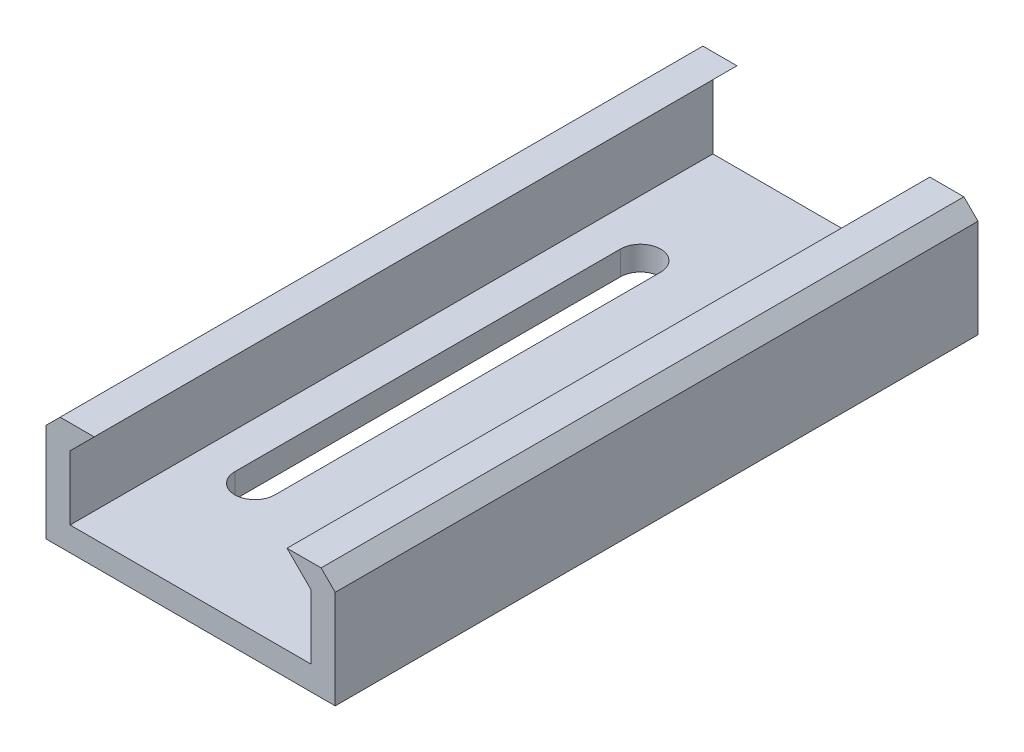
ISO-10303-21;
HEADER;
FILE_DESCRIPTION(('STEP AP214'),'2;1');
FILE_NAME('part.step','',(''),(''),'','','');
FILE_SCHEMA(('AUTOMOTIVE_DESIGN { 1 0 10303 214 1 1 1 1 }'));
ENDSEC;
DATA;
#1=APPLICATION_CONTEXT('core data for automotive mechanical design processes');
#2=APPLICATION_PROTOCOL_DEFINITION('international standard','automotive_design',2000,#1);
#3=PRODUCT_CONTEXT('',#1,'mechanical');
#4=PRODUCT('Part','Part','',(#3));
#5=PRODUCT_RELATED_PRODUCT_CATEGORY('part','',(#4));
#6=PRODUCT_DEFINITION_FORMATION('','',#4);
#7=PRODUCT_DEFINITION_CONTEXT('part definition',#1,'design');
#8=PRODUCT_DEFINITION('design','',#6,#7);
#9=PRODUCT_DEFINITION_SHAPE('','',#8);
#10=(LENGTH_UNIT() NAMED_UNIT(*) SI_UNIT(.MILLI.,.METRE.));
#11=(NAMED_UNIT(*) PLANE_ANGLE_UNIT() SI_UNIT($,.RADIAN.));
#12=(NAMED_UNIT(*) SI_UNIT($,.STERADIAN.) SOLID_ANGLE_UNIT());
#13=UNCERTAINTY_MEASURE_WITH_UNIT(LENGTH_MEASURE(1.E-05),#10,'distance_accuracy_value','');
#14=(GEOMETRIC_REPRESENTATION_CONTEXT(3) GLOBAL_UNCERTAINTY_ASSIGNED_CONTEXT((#13)) GLOBAL_UNIT_ASSIGNED_CONTEXT((#10,
#11,#12)) REPRESENTATION_CONTEXT('',''));
#15=CARTESIAN_POINT('',(0.,0.,0.));
#16=DIRECTION('',(0.,0.,1.));
#17=DIRECTION('',(1.,0.,0.));
#18=AXIS2_PLACEMENT_3D('',#15,#16,#17);
#19=CARTESIAN_POINT('',(-47.625,0.,-254.));
#20=DIRECTION('',(1.,0.,0.));
#21=DIRECTION('',(0.,0.,-1.));
#22=AXIS2_PLACEMENT_3D('',#19,#20,#21);
#23=PLANE('',#22);
#24=DIRECTION('',(0.,1.,0.));
#25=VECTOR('',#24,1.);
#26=CARTESIAN_POINT('',(-47.625,0.,0.));
#27=LINE('',#26,#25);
#28=CARTESIAN_POINT('',(-47.625,0.,0.));
#29=VERTEX_POINT('',#28);
#30=CARTESIAN_POINT('',(-47.625,25.4,0.));
#31=VERTEX_POINT('',#30);
#32=EDGE_CURVE('E231',#29,#31,#27,.T.);
#33=ORIENTED_EDGE('',*,*,#32,.F.);
#34=DIRECTION('',(0.,0.,1.));
#35=VECTOR('',#34,1.);
#36=CARTESIAN_POINT('',(-47.625,0.,-254.));
#37=LINE('',#36,#35);
#38=CARTESIAN_POINT('',(-47.625,0.,-254.));
#39=VERTEX_POINT('',#38);
#40=EDGE_CURVE('E11',#39,#29,#37,.T.);
#41=ORIENTED_EDGE('',*,*,#40,.F.);
#42=DIRECTION('',(0.,1.,0.));
#43=VECTOR('',#42,1.);
#44=CARTESIAN_POINT('',(-47.625,0.,-254.));
#45=LINE('',#44,#43);
#46=CARTESIAN_POINT('',(-47.625,25.4,-254.));
#47=VERTEX_POINT('',#46);
#48=EDGE_CURVE('E267',#39,#47,#45,.T.);
#49=ORIENTED_EDGE('',*,*,#48,.T.);
#50=DIRECTION('',(0.,0.,1.));
#51=VECTOR('',#50,1.);
#52=CARTESIAN_POINT('',(-47.625,25.4,-254.));
#53=LINE('',#52,#51);
#54=EDGE_CURVE('E31',#47,#31,#53,.T.);
#55=ORIENTED_EDGE('',*,*,#54,.T.);
#56=EDGE_LOOP('',(#33,#41,#49,#55));
#57=FACE_BOUND('',#56,.T.);
#58=ADVANCED_FACE('F28',(#57),#23,.T.);
#59=CARTESIAN_POINT('',(-47.625,0.,-254.));
#60=DIRECTION('',(0.,1.,0.));
#61=DIRECTION('',(0.,0.,1.));
#62=AXIS2_PLACEMENT_3D('',#59,#60,#61);
#63=PLANE('',#62);
#64=CARTESIAN_POINT('',(-25.4,0.,-50.7999999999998));
#65=DIRECTION('',(0.,1.,0.));
#66=DIRECTION('',(0.,0.,1.));
#67=AXIS2_PLACEMENT_3D('',#64,#65,#66);
#68=CIRCLE('',#67,7.93750000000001);
#69=CARTESIAN_POINT('',(-33.3375,0.,-50.7999999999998));
#70=VERTEX_POINT('',#69);
#71=CARTESIAN_POINT('',(-17.4625,0.,-50.7999999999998));
#72=VERTEX_POINT('',#71);
#73=EDGE_CURVE('E198',#70,#72,#68,.T.);
#74=ORIENTED_EDGE('',*,*,#73,.F.);
#75=DIRECTION('',(0.,0.,1.));
#76=VECTOR('',#75,1.);
#77=CARTESIAN_POINT('',(-33.3375,0.,-254.));
#78=LINE('',#77,#76);
#79=CARTESIAN_POINT('',(-33.3375,0.,-203.2));
#80=VERTEX_POINT('',#79);
#81=EDGE_CURVE('E191',#80,#70,#78,.T.);
#82=ORIENTED_EDGE('',*,*,#81,.F.);
#83=CARTESIAN_POINT('',(-25.4,0.,-203.2));
#84=DIRECTION('',(0.,1.,0.));
#85=DIRECTION('',(0.,0.,1.));
#86=AXIS2_PLACEMENT_3D('',#83,#84,#85);
#87=CIRCLE('',#86,7.93750000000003);
#88=CARTESIAN_POINT('',(-17.4624999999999,0.,-203.2));
#89=VERTEX_POINT('',#88);
#90=EDGE_CURVE('E171',#80,#89,#87,.F.);
#91=ORIENTED_EDGE('',*,*,#90,.T.);
#92=DIRECTION('',(0.,0.,-1.));
#93=VECTOR('',#92,1.);
#94=CARTESIAN_POINT('',(-17.4624999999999,0.,-254.));
#95=LINE('',#94,#93);
#96=EDGE_CURVE('E196',#72,#89,#95,.T.);
#97=ORIENTED_EDGE('',*,*,#96,.F.);
#98=EDGE_LOOP('',(#74,#82,#91,#97));
#99=FACE_BOUND('',#98,.T.);
#100=CARTESIAN_POINT('',(25.4,0.,-203.2));
#101=DIRECTION('',(0.,1.,0.));
#102=DIRECTION('',(0.,0.,1.));
#103=AXIS2_PLACEMENT_3D('',#100,#101,#102);
#104=CIRCLE('',#103,7.93750000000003);
#105=CARTESIAN_POINT('',(33.3375000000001,0.,-203.2));
#106=VERTEX_POINT('',#105);
#107=CARTESIAN_POINT('',(17.4625,0.,-203.2));
#108=VERTEX_POINT('',#107);
#109=EDGE_CURVE('E229',#106,#108,#104,.T.);
#110=ORIENTED_EDGE('',*,*,#109,.F.);
#111=DIRECTION('',(0.,0.,1.));
#112=VECTOR('',#111,1.);
#113=CARTESIAN_POINT('',(33.3375000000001,0.,-254.));
#114=LINE('',#113,#112);
#115=CARTESIAN_POINT('',(33.3375,0.,-50.7999999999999));
#116=VERTEX_POINT('',#115);
#117=EDGE_CURVE('E214',#106,#116,#114,.T.);
#118=ORIENTED_EDGE('',*,*,#117,.T.);
#119=CARTESIAN_POINT('',(25.4,0.,-50.7999999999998));
#120=DIRECTION('',(0.,1.,0.));
#121=DIRECTION('',(0.,0.,1.));
#122=AXIS2_PLACEMENT_3D('',#119,#120,#121);
#123=CIRCLE('',#122,7.93749999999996);
#124=CARTESIAN_POINT('',(17.4625,0.,-50.7999999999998));
#125=VERTEX_POINT('',#124);
#126=EDGE_CURVE('E223',#116,#125,#123,.F.);
#127=ORIENTED_EDGE('',*,*,#126,.T.);
#128=DIRECTION('',(0.,0.,-1.));
#129=VECTOR('',#128,1.);
#130=CARTESIAN_POINT('',(17.4625,0.,-254.));
#131=LINE('',#130,#129);
#132=EDGE_CURVE('E226',#125,#108,#131,.T.);
#133=ORIENTED_EDGE('',*,*,#132,.T.);
#134=EDGE_LOOP('',(#110,#118,#127,#133));
#135=FACE_BOUND('',#134,.T.);
#136=DIRECTION('',(-1.,0.,0.));
#137=VECTOR('',#136,1.);
#138=CARTESIAN_POINT('',(-47.625,0.,0.));
#139=LINE('',#138,#137);
#140=CARTESIAN_POINT('',(47.625,0.,0.));
#141=VERTEX_POINT('',#140);
#142=EDGE_CURVE('E264',#141,#29,#139,.T.);
#143=ORIENTED_EDGE('',*,*,#142,.F.);
#144=DIRECTION('',(0.,0.,1.));
#145=VECTOR('',#144,1.);
#146=CARTESIAN_POINT('',(47.625,0.,-254.));
#147=LINE('',#146,#145);
#148=CARTESIAN_POINT('',(47.625,0.,-254.));
#149=VERTEX_POINT('',#148);
#150=EDGE_CURVE('E36',#149,#141,#147,.T.);
#151=ORIENTED_EDGE('',*,*,#150,.F.);
#152=DIRECTION('',(-1.,0.,0.));
#153=VECTOR('',#152,1.);
#154=CARTESIAN_POINT('',(-47.625,0.,-254.));
#155=LINE('',#154,#153);
#156=EDGE_CURVE('E300',#149,#39,#155,.T.);
#157=ORIENTED_EDGE('',*,*,#156,.T.);
#158=ORIENTED_EDGE('',*,*,#40,.T.);
#159=EDGE_LOOP('',(#143,#151,#157,#158));
#160=FACE_BOUND('',#159,.T.);
#161=ADVANCED_FACE('F333',(#99,#135,#160),#63,.T.);
#162=CARTESIAN_POINT('',(47.625,0.,-254.));
#163=DIRECTION('',(-1.,0.,0.));
#164=DIRECTION('',(0.,0.,1.));
#165=AXIS2_PLACEMENT_3D('',#162,#163,#164);
#166=PLANE('',#165);
#167=DIRECTION('',(0.,-1.,0.));
#168=VECTOR('',#167,1.);
#169=CARTESIAN_POINT('',(47.625,0.,0.));
#170=LINE('',#169,#168);
#171=CARTESIAN_POINT('',(47.625,25.4,0.));
#172=VERTEX_POINT('',#171);
#173=EDGE_CURVE('E261',#172,#141,#170,.T.);
#174=ORIENTED_EDGE('',*,*,#173,.F.);
#175=DIRECTION('',(0.,0.,1.));
#176=VECTOR('',#175,1.);
#177=CARTESIAN_POINT('',(47.625,25.4,-254.));
#178=LINE('',#177,#176);
#179=CARTESIAN_POINT('',(47.625,25.4,-254.));
#180=VERTEX_POINT('',#179);
#181=EDGE_CURVE('E304',#180,#172,#178,.T.);
#182=ORIENTED_EDGE('',*,*,#181,.F.);
#183=DIRECTION('',(0.,-1.,0.));
#184=VECTOR('',#183,1.);
#185=CARTESIAN_POINT('',(47.625,0.,-254.));
#186=LINE('',#185,#184);
#187=EDGE_CURVE('E297',#180,#149,#186,.T.);
#188=ORIENTED_EDGE('',*,*,#187,.T.);
#189=ORIENTED_EDGE('',*,*,#150,.T.);
#190=EDGE_LOOP('',(#174,#182,#188,#189));
#191=FACE_BOUND('',#190,.T.);
#192=ADVANCED_FACE('F369',(#191),#166,.T.);
#193=CARTESIAN_POINT('',(38.1,34.925,-254.));
#194=DIRECTION('',(-0.707106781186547,-0.707106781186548,0.));
#195=DIRECTION('',(0.707106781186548,-0.707106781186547,0.));
#196=AXIS2_PLACEMENT_3D('',#193,#194,#195);
#197=PLANE('',#196);
#198=DIRECTION('',(0.707106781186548,-0.707106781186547,0.));
#199=VECTOR('',#198,1.);
#200=CARTESIAN_POINT('',(38.1,34.925,0.));
#201=LINE('',#200,#199);
#202=CARTESIAN_POINT('',(38.1,34.925,0.));
#203=VERTEX_POINT('',#202);
#204=EDGE_CURVE('E258',#203,#172,#201,.T.);
#205=ORIENTED_EDGE('',*,*,#204,.F.);
#206=DIRECTION('',(0.,0.,1.));
#207=VECTOR('',#206,1.);
#208=CARTESIAN_POINT('',(38.1,34.925,-254.));
#209=LINE('',#208,#207);
#210=CARTESIAN_POINT('',(38.1,34.925,-254.));
#211=VERTEX_POINT('',#210);
#212=EDGE_CURVE('E306',#211,#203,#209,.T.);
#213=ORIENTED_EDGE('',*,*,#212,.F.);
#214=DIRECTION('',(0.707106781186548,-0.707106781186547,0.));
#215=VECTOR('',#214,1.);
#216=CARTESIAN_POINT('',(38.1,34.925,-254.));
#217=LINE('',#216,#215);
#218=EDGE_CURVE('E294',#211,#180,#217,.T.);
#219=ORIENTED_EDGE('',*,*,#218,.T.);
#220=ORIENTED_EDGE('',*,*,#181,.T.);
#221=EDGE_LOOP('',(#205,#213,#219,#220));
#222=FACE_BOUND('',#221,.T.);
#223=ADVANCED_FACE('F366',(#222),#197,.T.);
#224=CARTESIAN_POINT('',(38.1,34.925,-254.));
#225=DIRECTION('',(0.,1.,0.));
#226=DIRECTION('',(-1.,0.,0.));
#227=AXIS2_PLACEMENT_3D('',#224,#225,#226);
#228=PLANE('',#227);
#229=DIRECTION('',(-1.,0.,0.));
#230=VECTOR('',#229,1.);
#231=CARTESIAN_POINT('',(38.1,34.925,0.));
#232=LINE('',#231,#230);
#233=CARTESIAN_POINT('',(51.5703841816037,34.925,0.));
#234=VERTEX_POINT('',#233);
#235=EDGE_CURVE('E255',#234,#203,#232,.T.);
#236=ORIENTED_EDGE('',*,*,#235,.F.);
#237=DIRECTION('',(0.,0.,1.));
#238=VECTOR('',#237,1.);
#239=CARTESIAN_POINT('',(51.5703841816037,34.925,-254.));
#240=LINE('',#239,#238);
#241=CARTESIAN_POINT('',(51.5703841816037,34.925,-254.));
#242=VERTEX_POINT('',#241);
#243=EDGE_CURVE('E308',#242,#234,#240,.T.);
#244=ORIENTED_EDGE('',*,*,#243,.F.);
#245=DIRECTION('',(-1.,0.,0.));
#246=VECTOR('',#245,1.);
#247=CARTESIAN_POINT('',(38.1,34.925,-254.));
#248=LINE('',#247,#246);
#249=EDGE_CURVE('E291',#242,#211,#248,.T.);
#250=ORIENTED_EDGE('',*,*,#249,.T.);
#251=ORIENTED_EDGE('',*,*,#212,.T.);
#252=EDGE_LOOP('',(#236,#244,#250,#251));
#253=FACE_BOUND('',#252,.T.);
#254=ADVANCED_FACE('F363',(#253),#228,.T.);
#255=CARTESIAN_POINT('',(51.5703841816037,34.925,-254.));
#256=DIRECTION('',(0.707106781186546,0.707106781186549,0.));
#257=DIRECTION('',(-0.707106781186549,0.707106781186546,0.));
#258=AXIS2_PLACEMENT_3D('',#255,#256,#257);
#259=PLANE('',#258);
#260=DIRECTION('',(-0.707106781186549,0.707106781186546,0.));
#261=VECTOR('',#260,1.);
#262=CARTESIAN_POINT('',(51.5703841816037,34.925,0.));
#263=LINE('',#262,#261);
#264=CARTESIAN_POINT('',(57.15,29.3453841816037,0.));
#265=VERTEX_POINT('',#264);
#266=EDGE_CURVE('E252',#265,#234,#263,.T.);
#267=ORIENTED_EDGE('',*,*,#266,.F.);
#268=DIRECTION('',(0.,0.,1.));
#269=VECTOR('',#268,1.);
#270=CARTESIAN_POINT('',(57.15,29.3453841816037,-254.));
#271=LINE('',#270,#269);
#272=CARTESIAN_POINT('',(57.15,29.3453841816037,-254.));
#273=VERTEX_POINT('',#272);
#274=EDGE_CURVE('E310',#273,#265,#271,.T.);
#275=ORIENTED_EDGE('',*,*,#274,.F.);
#276=DIRECTION('',(-0.707106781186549,0.707106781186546,0.));
#277=VECTOR('',#276,1.);
#278=CARTESIAN_POINT('',(51.5703841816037,34.925,-254.));
#279=LINE('',#278,#277);
#280=EDGE_CURVE('E288',#273,#242,#279,.T.);
#281=ORIENTED_EDGE('',*,*,#280,.T.);
#282=ORIENTED_EDGE('',*,*,#243,.T.);
#283=EDGE_LOOP('',(#267,#275,#281,#282));
#284=FACE_BOUND('',#283,.T.);
#285=ADVANCED_FACE('F359',(#284),#259,.T.);
#286=CARTESIAN_POINT('',(57.15,-9.525,-254.));
#287=DIRECTION('',(1.,0.,0.));
#288=DIRECTION('',(0.,0.,-1.));
#289=AXIS2_PLACEMENT_3D('',#286,#287,#288);
#290=PLANE('',#289);
#291=DIRECTION('',(0.,1.,0.));
#292=VECTOR('',#291,1.);
#293=CARTESIAN_POINT('',(57.15,-9.525,0.));
#294=LINE('',#293,#292);
#295=CARTESIAN_POINT('',(57.15,-9.525,0.));
#296=VERTEX_POINT('',#295);
#297=EDGE_CURVE('E249',#296,#265,#294,.T.);
#298=ORIENTED_EDGE('',*,*,#297,.F.);
#299=DIRECTION('',(0.,0.,1.));
#300=VECTOR('',#299,1.);
#301=CARTESIAN_POINT('',(57.15,-9.525,-254.));
#302=LINE('',#301,#300);
#303=CARTESIAN_POINT('',(57.15,-9.525,-254.));
#304=VERTEX_POINT('',#303);
#305=EDGE_CURVE('E312',#304,#296,#302,.T.);
#306=ORIENTED_EDGE('',*,*,#305,.F.);
#307=DIRECTION('',(0.,1.,0.));
#308=VECTOR('',#307,1.);
#309=CARTESIAN_POINT('',(57.15,-9.525,-254.));
#310=LINE('',#309,#308);
#311=EDGE_CURVE('E285',#304,#273,#310,.T.);
#312=ORIENTED_EDGE('',*,*,#311,.T.);
#313=ORIENTED_EDGE('',*,*,#274,.T.);
#314=EDGE_LOOP('',(#298,#306,#312,#313));
#315=FACE_BOUND('',#314,.T.);
#316=ADVANCED_FACE('F355',(#315),#290,.T.);
#317=CARTESIAN_POINT('',(-57.15,-9.525,-254.));
#318=DIRECTION('',(0.,-1.,0.));
#319=DIRECTION('',(0.,0.,-1.));
#320=AXIS2_PLACEMENT_3D('',#317,#318,#319);
#321=PLANE('',#320);
#322=CARTESIAN_POINT('',(-25.4,-9.52499999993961,-50.7999999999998));
#323=DIRECTION('',(0.,-1.,0.));
#324=DIRECTION('',(0.,0.,-1.));
#325=AXIS2_PLACEMENT_3D('',#322,#323,#324);
#326=CIRCLE('',#325,7.93750000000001);
#327=CARTESIAN_POINT('',(-17.4625,-9.52499999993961,-50.7999999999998));
#328=VERTEX_POINT('',#327);
#329=CARTESIAN_POINT('',(-33.3375,-9.525,-50.7999999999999));
#330=VERTEX_POINT('',#329);
#331=EDGE_CURVE('E52',#328,#330,#326,.T.);
#332=ORIENTED_EDGE('',*,*,#331,.F.);
#333=DIRECTION('',(0.,0.,1.));
#334=VECTOR('',#333,1.);
#335=CARTESIAN_POINT('',(-17.4624999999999,-9.52499999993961,-203.2));
#336=LINE('',#335,#334);
#337=CARTESIAN_POINT('',(-17.4624999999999,-9.52499999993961,-203.2));
#338=VERTEX_POINT('',#337);
#339=EDGE_CURVE('E184',#338,#328,#336,.T.);
#340=ORIENTED_EDGE('',*,*,#339,.F.);
#341=CARTESIAN_POINT('',(-25.4,-9.52499999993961,-203.2));
#342=DIRECTION('',(0.,1.,0.));
#343=DIRECTION('',(0.,0.,1.));
#344=AXIS2_PLACEMENT_3D('',#341,#342,#343);
#345=CIRCLE('',#344,7.93750000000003);
#346=CARTESIAN_POINT('',(-33.3375,-9.52499999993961,-203.2));
#347=VERTEX_POINT('',#346);
#348=EDGE_CURVE('E168',#338,#347,#345,.T.);
#349=ORIENTED_EDGE('',*,*,#348,.T.);
#350=DIRECTION('',(0.,0.,-1.));
#351=VECTOR('',#350,1.);
#352=CARTESIAN_POINT('',(-33.3375,-9.52499999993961,-50.7999999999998));
#353=LINE('',#352,#351);
#354=EDGE_CURVE('E177',#330,#347,#353,.T.);
#355=ORIENTED_EDGE('',*,*,#354,.F.);
#356=EDGE_LOOP('',(#332,#340,#349,#355));
#357=FACE_BOUND('',#356,.T.);
#358=CARTESIAN_POINT('',(25.4,-9.52499999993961,-203.2));
#359=DIRECTION('',(0.,-1.,0.));
#360=DIRECTION('',(0.,0.,-1.));
#361=AXIS2_PLACEMENT_3D('',#358,#359,#360);
#362=CIRCLE('',#361,7.93750000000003);
#363=CARTESIAN_POINT('',(17.4625,-9.52499999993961,-203.2));
#364=VERTEX_POINT('',#363);
#365=CARTESIAN_POINT('',(33.3375000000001,-9.525,-203.2));
#366=VERTEX_POINT('',#365);
#367=EDGE_CURVE('E200',#364,#366,#362,.T.);
#368=ORIENTED_EDGE('',*,*,#367,.F.);
#369=DIRECTION('',(0.,0.,1.));
#370=VECTOR('',#369,1.);
#371=CARTESIAN_POINT('',(17.4625,-9.52499999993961,-203.2));
#372=LINE('',#371,#370);
#373=CARTESIAN_POINT('',(17.4625,-9.52499999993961,-50.7999999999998));
#374=VERTEX_POINT('',#373);
#375=EDGE_CURVE('E208',#364,#374,#372,.T.);
#376=ORIENTED_EDGE('',*,*,#375,.T.);
#377=CARTESIAN_POINT('',(25.4,-9.52499999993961,-50.7999999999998));
#378=DIRECTION('',(0.,1.,0.));
#379=DIRECTION('',(0.,0.,1.));
#380=AXIS2_PLACEMENT_3D('',#377,#378,#379);
#381=CIRCLE('',#380,7.93749999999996);
#382=CARTESIAN_POINT('',(33.3375,-9.52499999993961,-50.7999999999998));
#383=VERTEX_POINT('',#382);
#384=EDGE_CURVE('E205',#374,#383,#381,.T.);
#385=ORIENTED_EDGE('',*,*,#384,.T.);
#386=DIRECTION('',(0.,0.,-1.));
#387=VECTOR('',#386,1.);
#388=CARTESIAN_POINT('',(33.3375,-9.52499999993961,-50.7999999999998));
#389=LINE('',#388,#387);
#390=EDGE_CURVE('E202',#383,#366,#389,.T.);
#391=ORIENTED_EDGE('',*,*,#390,.T.);
#392=EDGE_LOOP('',(#368,#376,#385,#391));
#393=FACE_BOUND('',#392,.T.);
#394=DIRECTION('',(1.,0.,0.));
#395=VECTOR('',#394,1.);
#396=CARTESIAN_POINT('',(-57.15,-9.525,0.));
#397=LINE('',#396,#395);
#398=CARTESIAN_POINT('',(-57.15,-9.525,0.));
#399=VERTEX_POINT('',#398);
#400=EDGE_CURVE('E246',#399,#296,#397,.T.);
#401=ORIENTED_EDGE('',*,*,#400,.F.);
#402=DIRECTION('',(0.,0.,1.));
#403=VECTOR('',#402,1.);
#404=CARTESIAN_POINT('',(-57.15,-9.525,-254.));
#405=LINE('',#404,#403);
#406=CARTESIAN_POINT('',(-57.15,-9.525,-254.));
#407=VERTEX_POINT('',#406);
#408=EDGE_CURVE('E314',#407,#399,#405,.T.);
#409=ORIENTED_EDGE('',*,*,#408,.F.);
#410=DIRECTION('',(1.,0.,0.));
#411=VECTOR('',#410,1.);
#412=CARTESIAN_POINT('',(-57.15,-9.525,-254.));
#413=LINE('',#412,#411);
#414=EDGE_CURVE('E282',#407,#304,#413,.T.);
#415=ORIENTED_EDGE('',*,*,#414,.T.);
#416=ORIENTED_EDGE('',*,*,#305,.T.);
#417=EDGE_LOOP('',(#401,#409,#415,#416));
#418=FACE_BOUND('',#417,.T.);
#419=ADVANCED_FACE('F181',(#357,#393,#418),#321,.T.);
#420=CARTESIAN_POINT('',(-57.15,-9.525,-254.));
#421=DIRECTION('',(-1.,0.,0.));
#422=DIRECTION('',(0.,0.,1.));
#423=AXIS2_PLACEMENT_3D('',#420,#421,#422);
#424=PLANE('',#423);
#425=DIRECTION('',(0.,-1.,0.));
#426=VECTOR('',#425,1.);
#427=CARTESIAN_POINT('',(-57.15,-9.525,0.));
#428=LINE('',#427,#426);
#429=CARTESIAN_POINT('',(-57.15,29.3453841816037,0.));
#430=VERTEX_POINT('',#429);
#431=EDGE_CURVE('E243',#430,#399,#428,.T.);
#432=ORIENTED_EDGE('',*,*,#431,.F.);
#433=DIRECTION('',(0.,0.,1.));
#434=VECTOR('',#433,1.);
#435=CARTESIAN_POINT('',(-57.15,29.3453841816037,-254.));
#436=LINE('',#435,#434);
#437=CARTESIAN_POINT('',(-57.15,29.3453841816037,-254.));
#438=VERTEX_POINT('',#437);
#439=EDGE_CURVE('E316',#438,#430,#436,.T.);
#440=ORIENTED_EDGE('',*,*,#439,.F.);
#441=DIRECTION('',(0.,-1.,0.));
#442=VECTOR('',#441,1.);
#443=CARTESIAN_POINT('',(-57.15,-9.525,-254.));
#444=LINE('',#443,#442);
#445=EDGE_CURVE('E279',#438,#407,#444,.T.);
#446=ORIENTED_EDGE('',*,*,#445,.T.);
#447=ORIENTED_EDGE('',*,*,#408,.T.);
#448=EDGE_LOOP('',(#432,#440,#446,#447));
#449=FACE_BOUND('',#448,.T.);
#450=ADVANCED_FACE('F348',(#449),#424,.T.);
#451=CARTESIAN_POINT('',(-57.15,29.3453841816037,-254.));
#452=DIRECTION('',(-0.707106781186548,0.707106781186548,0.));
#453=DIRECTION('',(-0.707106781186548,-0.707106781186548,0.));
#454=AXIS2_PLACEMENT_3D('',#451,#452,#453);
#455=PLANE('',#454);
#456=DIRECTION('',(-0.707106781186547,-0.707106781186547,0.));
#457=VECTOR('',#456,1.);
#458=CARTESIAN_POINT('',(-57.15,29.3453841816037,0.));
#459=LINE('',#458,#457);
#460=CARTESIAN_POINT('',(-51.5703841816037,34.925,0.));
#461=VERTEX_POINT('',#460);
#462=EDGE_CURVE('E240',#461,#430,#459,.T.);
#463=ORIENTED_EDGE('',*,*,#462,.F.);
#464=DIRECTION('',(0.,0.,1.));
#465=VECTOR('',#464,1.);
#466=CARTESIAN_POINT('',(-51.5703841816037,34.925,-254.));
#467=LINE('',#466,#465);
#468=CARTESIAN_POINT('',(-51.5703841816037,34.925,-254.));
#469=VERTEX_POINT('',#468);
#470=EDGE_CURVE('E318',#469,#461,#467,.T.);
#471=ORIENTED_EDGE('',*,*,#470,.F.);
#472=DIRECTION('',(-0.707106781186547,-0.707106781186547,0.));
#473=VECTOR('',#472,1.);
#474=CARTESIAN_POINT('',(-57.15,29.3453841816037,-254.));
#475=LINE('',#474,#473);
#476=EDGE_CURVE('E276',#469,#438,#475,.T.);
#477=ORIENTED_EDGE('',*,*,#476,.T.);
#478=ORIENTED_EDGE('',*,*,#439,.T.);
#479=EDGE_LOOP('',(#463,#471,#477,#478));
#480=FACE_BOUND('',#479,.T.);
#481=ADVANCED_FACE('F346',(#480),#455,.T.);
#482=CARTESIAN_POINT('',(-51.5703841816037,34.925,-254.));
#483=DIRECTION('',(0.,1.,0.));
#484=DIRECTION('',(-1.,0.,0.));
#485=AXIS2_PLACEMENT_3D('',#482,#483,#484);
#486=PLANE('',#485);
#487=DIRECTION('',(-1.,0.,0.));
#488=VECTOR('',#487,1.);
#489=CARTESIAN_POINT('',(-51.5703841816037,34.925,0.));
#490=LINE('',#489,#488);
#491=CARTESIAN_POINT('',(-38.1,34.925,0.));
#492=VERTEX_POINT('',#491);
#493=EDGE_CURVE('E237',#492,#461,#490,.T.);
#494=ORIENTED_EDGE('',*,*,#493,.F.);
#495=DIRECTION('',(0.,0.,1.));
#496=VECTOR('',#495,1.);
#497=CARTESIAN_POINT('',(-38.1,34.925,-254.));
#498=LINE('',#497,#496);
#499=CARTESIAN_POINT('',(-38.1,34.925,-254.));
#500=VERTEX_POINT('',#499);
#501=EDGE_CURVE('E319',#500,#492,#498,.T.);
#502=ORIENTED_EDGE('',*,*,#501,.F.);
#503=DIRECTION('',(-1.,0.,0.));
#504=VECTOR('',#503,1.);
#505=CARTESIAN_POINT('',(-51.5703841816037,34.925,-254.));
#506=LINE('',#505,#504);
#507=EDGE_CURVE('E273',#500,#469,#506,.T.);
#508=ORIENTED_EDGE('',*,*,#507,.T.);
#509=ORIENTED_EDGE('',*,*,#470,.T.);
#510=EDGE_LOOP('',(#494,#502,#508,#509));
#511=FACE_BOUND('',#510,.T.);
#512=ADVANCED_FACE('F342',(#511),#486,.T.);
#513=CARTESIAN_POINT('',(-47.625,25.4,-254.));
#514=DIRECTION('',(0.707106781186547,-0.707106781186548,0.));
#515=DIRECTION('',(0.707106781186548,0.707106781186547,0.));
#516=AXIS2_PLACEMENT_3D('',#513,#514,#515);
#517=PLANE('',#516);
#518=DIRECTION('',(0.707106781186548,0.707106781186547,0.));
#519=VECTOR('',#518,1.);
#520=CARTESIAN_POINT('',(-47.625,25.4,0.));
#521=LINE('',#520,#519);
#522=EDGE_CURVE('E234',#31,#492,#521,.T.);
#523=ORIENTED_EDGE('',*,*,#522,.F.);
#524=ORIENTED_EDGE('',*,*,#54,.F.);
#525=DIRECTION('',(0.707106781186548,0.707106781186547,0.));
#526=VECTOR('',#525,1.);
#527=CARTESIAN_POINT('',(-47.625,25.4,-254.));
#528=LINE('',#527,#526);
#529=EDGE_CURVE('E270',#47,#500,#528,.T.);
#530=ORIENTED_EDGE('',*,*,#529,.T.);
#531=ORIENTED_EDGE('',*,*,#501,.T.);
#532=EDGE_LOOP('',(#523,#524,#530,#531));
#533=FACE_BOUND('',#532,.T.);
#534=ADVANCED_FACE('F327',(#533),#517,.T.);
#535=CARTESIAN_POINT('',(-47.625,-9.525,-254.));
#536=DIRECTION('',(0.,0.,-1.));
#537=DIRECTION('',(-1.,0.,0.));
#538=AXIS2_PLACEMENT_3D('',#535,#536,#537);
#539=PLANE('',#538);
#540=ORIENTED_EDGE('',*,*,#48,.F.);
#541=ORIENTED_EDGE('',*,*,#156,.F.);
#542=ORIENTED_EDGE('',*,*,#187,.F.);
#543=ORIENTED_EDGE('',*,*,#218,.F.);
#544=ORIENTED_EDGE('',*,*,#249,.F.);
#545=ORIENTED_EDGE('',*,*,#280,.F.);
#546=ORIENTED_EDGE('',*,*,#311,.F.);
#547=ORIENTED_EDGE('',*,*,#414,.F.);
#548=ORIENTED_EDGE('',*,*,#445,.F.);
#549=ORIENTED_EDGE('',*,*,#476,.F.);
#550=ORIENTED_EDGE('',*,*,#507,.F.);
#551=ORIENTED_EDGE('',*,*,#529,.F.);
#552=EDGE_LOOP('',(#540,#541,#542,#543,#544,#545,#546,#547,#548,#549,#550,#551));
#553=FACE_BOUND('',#552,.T.);
#554=ADVANCED_FACE('F336',(#553),#539,.T.);
#555=CARTESIAN_POINT('',(-47.625,-9.525,0.));
#556=DIRECTION('',(0.,0.,-1.));
#557=DIRECTION('',(-1.,0.,0.));
#558=AXIS2_PLACEMENT_3D('',#555,#556,#557);
#559=PLANE('',#558);
#560=ORIENTED_EDGE('',*,*,#32,.T.);
#561=ORIENTED_EDGE('',*,*,#522,.T.);
#562=ORIENTED_EDGE('',*,*,#493,.T.);
#563=ORIENTED_EDGE('',*,*,#462,.T.);
#564=ORIENTED_EDGE('',*,*,#431,.T.);
#565=ORIENTED_EDGE('',*,*,#400,.T.);
#566=ORIENTED_EDGE('',*,*,#297,.T.);
#567=ORIENTED_EDGE('',*,*,#266,.T.);
#568=ORIENTED_EDGE('',*,*,#235,.T.);
#569=ORIENTED_EDGE('',*,*,#204,.T.);
#570=ORIENTED_EDGE('',*,*,#173,.T.);
#571=ORIENTED_EDGE('',*,*,#142,.T.);
#572=EDGE_LOOP('',(#560,#561,#562,#563,#564,#565,#566,#567,#568,#569,#570,#571));
#573=FACE_BOUND('',#572,.T.);
#574=ADVANCED_FACE('F329',(#573),#559,.F.);
#575=CARTESIAN_POINT('',(25.4,34.925,-203.2));
#576=DIRECTION('',(0.,-1.,0.));
#577=DIRECTION('',(0.,0.,-1.));
#578=AXIS2_PLACEMENT_3D('',#575,#576,#577);
#579=CYLINDRICAL_SURFACE('',#578,7.93750000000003);
#580=ORIENTED_EDGE('',*,*,#109,.T.);
#581=DIRECTION('',(0.,-1.,0.));
#582=VECTOR('',#581,1.);
#583=CARTESIAN_POINT('',(17.4625,34.925,-203.2));
#584=LINE('',#583,#582);
#585=EDGE_CURVE('E212',#108,#364,#584,.T.);
#586=ORIENTED_EDGE('',*,*,#585,.T.);
#587=ORIENTED_EDGE('',*,*,#367,.T.);
#588=DIRECTION('',(0.,-1.,0.));
#589=VECTOR('',#588,1.);
#590=CARTESIAN_POINT('',(33.3375000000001,34.925,-203.2));
#591=LINE('',#590,#589);
#592=EDGE_CURVE('E211',#106,#366,#591,.T.);
#593=ORIENTED_EDGE('',*,*,#592,.F.);
#594=EDGE_LOOP('',(#580,#586,#587,#593));
#595=FACE_BOUND('',#594,.T.);
#596=ADVANCED_FACE('F453',(#595),#579,.F.);
#597=CARTESIAN_POINT('',(17.4625,34.925,-203.2));
#598=DIRECTION('',(1.,0.,0.));
#599=DIRECTION('',(0.,0.,-1.));
#600=AXIS2_PLACEMENT_3D('',#597,#598,#599);
#601=PLANE('',#600);
#602=DIRECTION('',(0.,-1.,0.));
#603=VECTOR('',#602,1.);
#604=CARTESIAN_POINT('',(17.4625,34.925,-50.7999999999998));
#605=LINE('',#604,#603);
#606=EDGE_CURVE('E215',#125,#374,#605,.T.);
#607=ORIENTED_EDGE('',*,*,#606,.T.);
#608=ORIENTED_EDGE('',*,*,#375,.F.);
#609=ORIENTED_EDGE('',*,*,#585,.F.);
#610=ORIENTED_EDGE('',*,*,#132,.F.);
#611=EDGE_LOOP('',(#607,#608,#609,#610));
#612=FACE_BOUND('',#611,.T.);
#613=ADVANCED_FACE('F459',(#612),#601,.T.);
#614=CARTESIAN_POINT('',(25.4,34.925,-50.7999999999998));
#615=DIRECTION('',(0.,-1.,0.));
#616=DIRECTION('',(0.,0.,-1.));
#617=AXIS2_PLACEMENT_3D('',#614,#615,#616);
#618=CYLINDRICAL_SURFACE('',#617,7.93749999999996);
#619=DIRECTION('',(0.,-1.,0.));
#620=VECTOR('',#619,1.);
#621=CARTESIAN_POINT('',(33.3375,34.925,-50.7999999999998));
#622=LINE('',#621,#620);
#623=EDGE_CURVE('E217',#116,#383,#622,.T.);
#624=ORIENTED_EDGE('',*,*,#623,.T.);
#625=ORIENTED_EDGE('',*,*,#384,.F.);
#626=ORIENTED_EDGE('',*,*,#606,.F.);
#627=ORIENTED_EDGE('',*,*,#126,.F.);
#628=EDGE_LOOP('',(#624,#625,#626,#627));
#629=FACE_BOUND('',#628,.T.);
#630=ADVANCED_FACE('F467',(#629),#618,.F.);
#631=CARTESIAN_POINT('',(33.3375,34.925,-50.7999999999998));
#632=DIRECTION('',(-1.,0.,0.));
#633=DIRECTION('',(0.,0.,1.));
#634=AXIS2_PLACEMENT_3D('',#631,#632,#633);
#635=PLANE('',#634);
#636=ORIENTED_EDGE('',*,*,#592,.T.);
#637=ORIENTED_EDGE('',*,*,#390,.F.);
#638=ORIENTED_EDGE('',*,*,#623,.F.);
#639=ORIENTED_EDGE('',*,*,#117,.F.);
#640=EDGE_LOOP('',(#636,#637,#638,#639));
#641=FACE_BOUND('',#640,.T.);
#642=ADVANCED_FACE('F475',(#641),#635,.T.);
#643=CARTESIAN_POINT('',(-25.4,34.925,-50.7999999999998));
#644=DIRECTION('',(0.,-1.,0.));
#645=DIRECTION('',(0.,0.,-1.));
#646=AXIS2_PLACEMENT_3D('',#643,#644,#645);
#647=CYLINDRICAL_SURFACE('',#646,7.93750000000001);
#648=ORIENTED_EDGE('',*,*,#73,.T.);
#649=DIRECTION('',(0.,-1.,0.));
#650=VECTOR('',#649,1.);
#651=CARTESIAN_POINT('',(-17.4625,34.925,-50.7999999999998));
#652=LINE('',#651,#650);
#653=EDGE_CURVE('E189',#72,#328,#652,.T.);
#654=ORIENTED_EDGE('',*,*,#653,.T.);
#655=ORIENTED_EDGE('',*,*,#331,.T.);
#656=DIRECTION('',(0.,-1.,0.));
#657=VECTOR('',#656,1.);
#658=CARTESIAN_POINT('',(-33.3375,34.925,-50.7999999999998));
#659=LINE('',#658,#657);
#660=EDGE_CURVE('E174',#70,#330,#659,.T.);
#661=ORIENTED_EDGE('',*,*,#660,.F.);
#662=EDGE_LOOP('',(#648,#654,#655,#661));
#663=FACE_BOUND('',#662,.T.);
#664=ADVANCED_FACE('F483',(#663),#647,.F.);
#665=CARTESIAN_POINT('',(-17.4624999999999,34.925,-203.2));
#666=DIRECTION('',(1.,0.,0.));
#667=DIRECTION('',(0.,0.,-1.));
#668=AXIS2_PLACEMENT_3D('',#665,#666,#667);
#669=PLANE('',#668);
#670=ORIENTED_EDGE('',*,*,#96,.T.);
#671=DIRECTION('',(0.,-1.,0.));
#672=VECTOR('',#671,1.);
#673=CARTESIAN_POINT('',(-17.4624999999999,34.925,-203.2));
#674=LINE('',#673,#672);
#675=EDGE_CURVE('E173',#89,#338,#674,.T.);
#676=ORIENTED_EDGE('',*,*,#675,.T.);
#677=ORIENTED_EDGE('',*,*,#339,.T.);
#678=ORIENTED_EDGE('',*,*,#653,.F.);
#679=EDGE_LOOP('',(#670,#676,#677,#678));
#680=FACE_BOUND('',#679,.T.);
#681=ADVANCED_FACE('F491',(#680),#669,.F.);
#682=CARTESIAN_POINT('',(-25.4,34.925,-203.2));
#683=DIRECTION('',(0.,-1.,0.));
#684=DIRECTION('',(0.,0.,-1.));
#685=AXIS2_PLACEMENT_3D('',#682,#683,#684);
#686=CYLINDRICAL_SURFACE('',#685,7.93750000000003);
#687=DIRECTION('',(0.,-1.,0.));
#688=VECTOR('',#687,1.);
#689=CARTESIAN_POINT('',(-33.3375,34.925,-203.2));
#690=LINE('',#689,#688);
#691=EDGE_CURVE('E44',#80,#347,#690,.T.);
#692=ORIENTED_EDGE('',*,*,#691,.T.);
#693=ORIENTED_EDGE('',*,*,#348,.F.);
#694=ORIENTED_EDGE('',*,*,#675,.F.);
#695=ORIENTED_EDGE('',*,*,#90,.F.);
#696=EDGE_LOOP('',(#692,#693,#694,#695));
#697=FACE_BOUND('',#696,.T.);
#698=ADVANCED_FACE('F165',(#697),#686,.F.);
#699=CARTESIAN_POINT('',(-33.3375,34.925,-50.7999999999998));
#700=DIRECTION('',(-1.,0.,0.));
#701=DIRECTION('',(0.,0.,1.));
#702=AXIS2_PLACEMENT_3D('',#699,#700,#701);
#703=PLANE('',#702);
#704=ORIENTED_EDGE('',*,*,#81,.T.);
#705=ORIENTED_EDGE('',*,*,#660,.T.);
#706=ORIENTED_EDGE('',*,*,#354,.T.);
#707=ORIENTED_EDGE('',*,*,#691,.F.);
#708=EDGE_LOOP('',(#704,#705,#706,#707));
#709=FACE_BOUND('',#708,.T.);
#710=ADVANCED_FACE('F178',(#709),#703,.F.);
#711=CLOSED_SHELL('',(#58,#161,#192,#223,#254,#285,#316,#419,#450,#481,#512,#534,#554,#574,#596,
#613,#630,#642,#664,#681,#698,#710));
#712=MANIFOLD_SOLID_BREP('B2',#711);
#713=ADVANCED_BREP_SHAPE_REPRESENTATION('',(#18,#712),#14);
#714=SHAPE_DEFINITION_REPRESENTATION(#9,#713);
ENDSEC;
END-ISO-10303-21;
